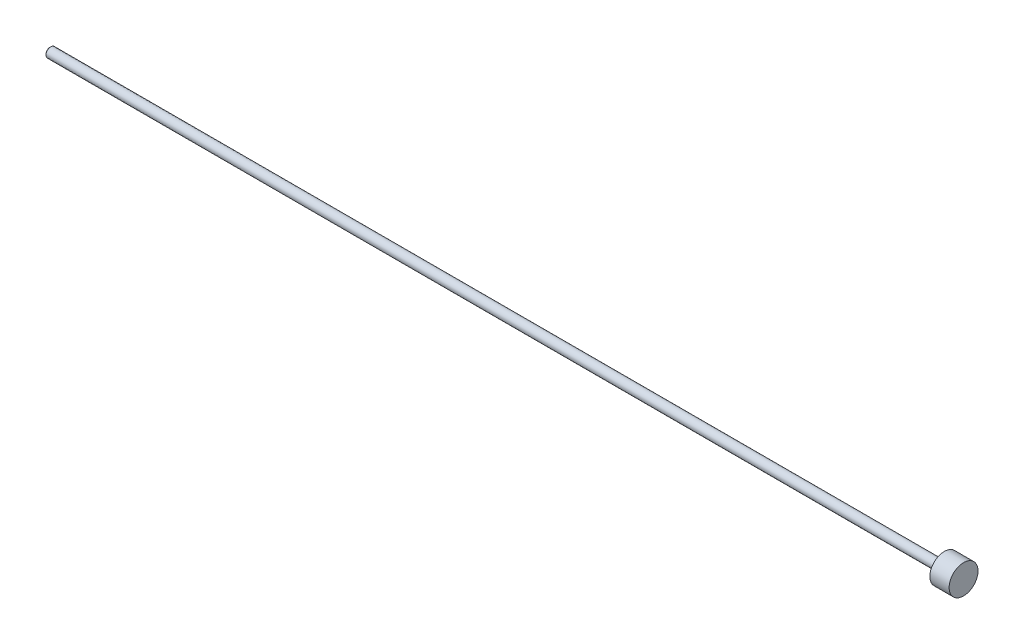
from build123d import *

# Parameters (mm, degrees)
SKETCH2_R               = 3.175
MAIN_BODY_DEPTH         = 602.107
SKETCH3_R               = 9.525
PISTON_SIMULATION_DEPTH = 12.7
CHAMFER1_SIZE           = 0.508


with BuildPart() as part:
    # Sketch2 → Main_body (new body)
    with BuildSketch(Plane.ZY.offset(-906.083186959)):
        Circle(SKETCH2_R)
    extrude(amount=MAIN_BODY_DEPTH)

    # Sketch3 → Piston Simulation (add)
    with BuildSketch(Plane.ZY.offset(-906.083186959)):
        Circle(SKETCH3_R)
    extrude(amount=PISTON_SIMULATION_DEPTH)

    # Chamfer1
    chamfer1_edges = [part.edges().sort_by_distance(p)[0] for p in [
        (303.976186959, 0, -3.175),
    ]]
    chamfer(chamfer1_edges, length=CHAMFER1_SIZE)


solid = part.part
